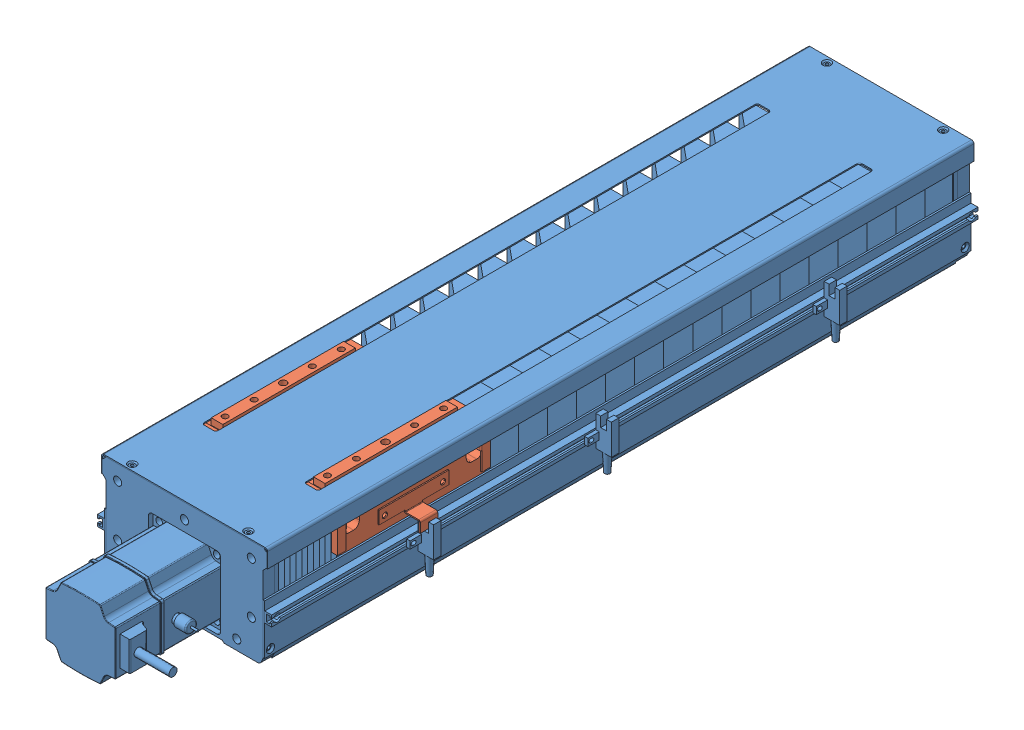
SolidWorks assembly 装配体7.sldasm, configuration 默认 (file format 9000). Lengths in mm.
Overall size (163.4 91 697.5).
2 component instances, 2 part files, 3 mates.
Components (placement in the parent):
- TCD135PS350-风琴罩滑台-1: TCD135PS350-风琴罩滑台.SLDPRT [默认] at (-10.7433 -60.8006 652.7525) size (163.4 89.5 697.5)
- TCD135PS100-滑台-1: TCD135PS100-滑台.SLDPRT [默认] at (-10.7433 -60.8006 777.7525) size (150 75.5 138)
Mates (geometry in assembly coordinates):
- 同心1: concentric anti-aligned: cylinder of TCD135PS350-风琴罩滑台-1 through (-10.7433 -25.3006 909.2525) axis (0 0 1) radius 8; cylinder of TCD135PS100-滑台-1 through (-10.7433 -25.3006 892.7525) axis (0 0 -1) radius 14.25
- 平行1: parallel aligned: plane of TCD135PS350-风琴罩滑台-1 through (-10.7433 28.6994 652.7525) normal (0 1 0); plane of TCD135PS100-滑台-1 through (-110.2433 24.6994 770.7525) normal (0 1 0)
- LimitDistance1: limit distance = 12 mm anti-aligned: plane of TCD135PS100-滑台-1 through (-10.7433 -29.3006 847.7525) normal (0 0 1); plane of TCD135PS350-风琴罩滑台-1 through (-46.2433 -25.3006 859.7525) normal (0 0 -1)
